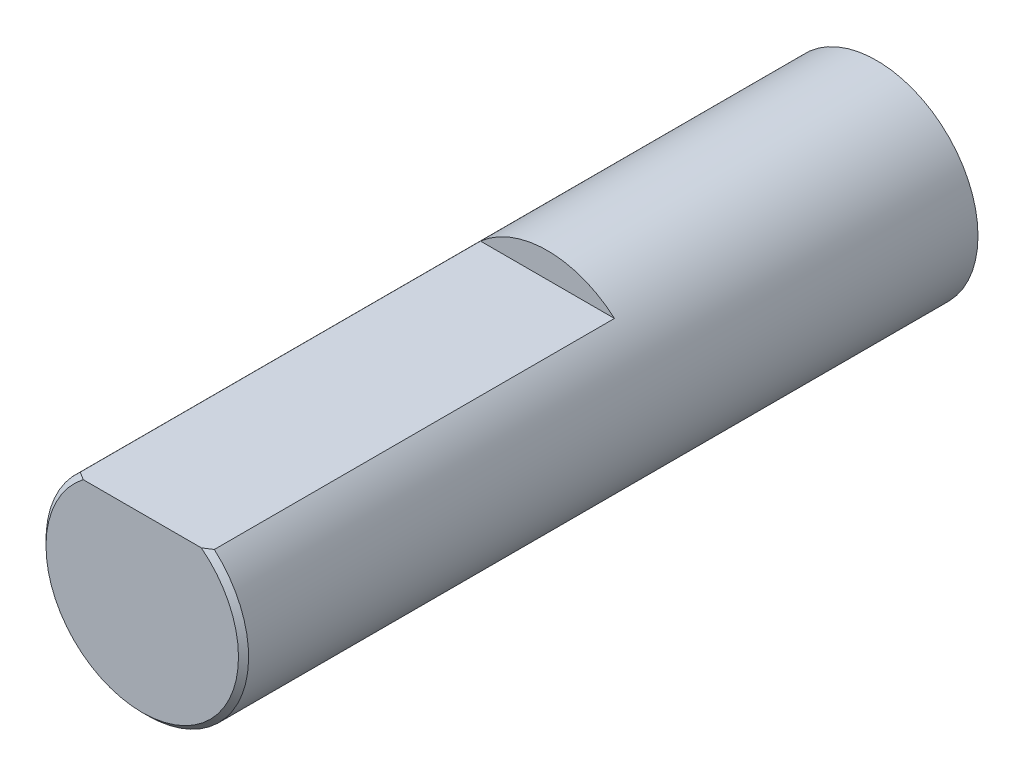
from build123d import *

# Parameters (mm, degrees)
SKETCH1_R           = 2
BOSS_EXTRUDE1_DEPTH = 14.5
CUT_EXTRUDE1_START  = -8
CUT_EXTRUDE1_DEPTH  = 8
CHAMFER1_SIZE       = 0.1


with BuildPart() as part:
    # Sketch1 → Boss-Extrude1 (new body)
    with BuildSketch(Plane.XY):
        with Locations(Location((0, 0, 0), (0, 0, 180))):
            Circle(SKETCH1_R)
    extrude(amount=BOSS_EXTRUDE1_DEPTH)

    # Sketch2 → Cut-Extrude1 (cut)
    with BuildSketch(Plane.XY.offset(14.5).offset(CUT_EXTRUDE1_START)):
        with BuildLine():
            Line((-1.322875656, 1.5), (1.322875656, 1.5))
            ThreePointArc((1.322875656, 1.5), (0, 2), (-1.322875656, 1.5))
        make_face()
    extrude(amount=CUT_EXTRUDE1_DEPTH, mode=Mode.SUBTRACT)

    # Chamfer1
    chamfer1_edges = [part.edges().sort_by_distance(p)[0] for p in [
        (0.822875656, -1.822875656, 14.5),
    ]]
    chamfer(chamfer1_edges, length=CHAMFER1_SIZE)


solid = part.part
